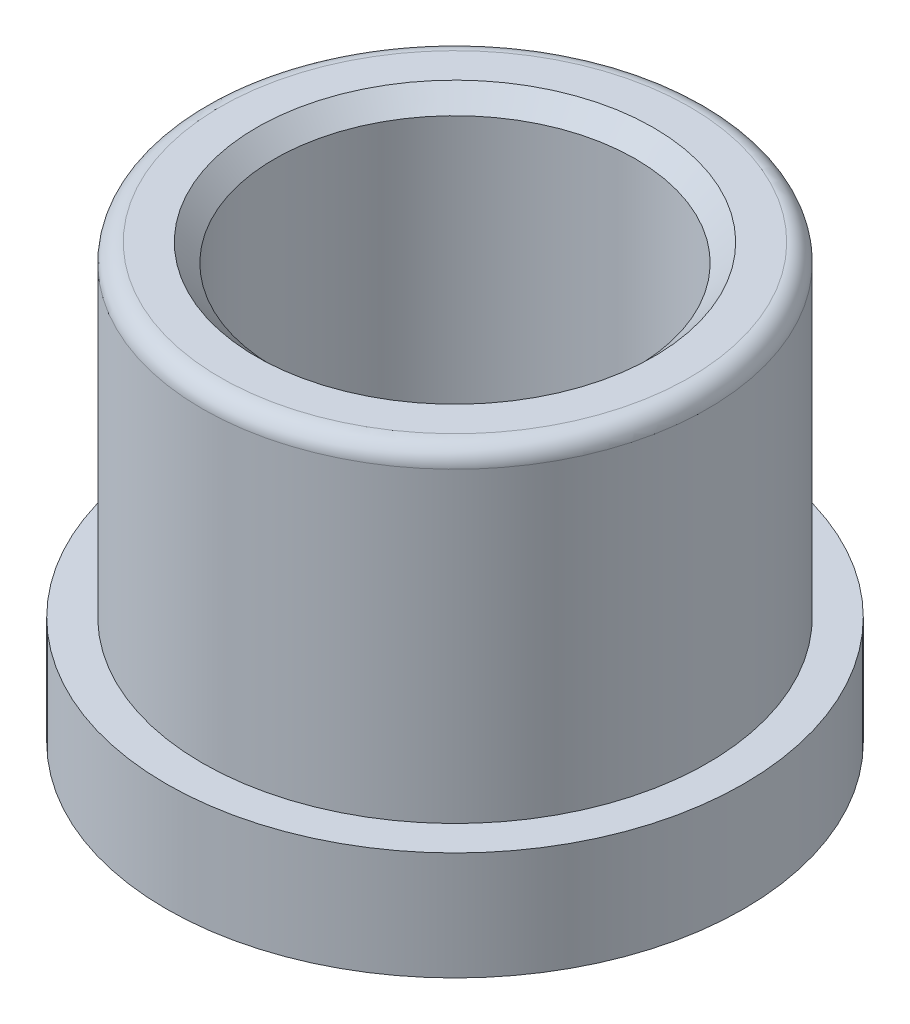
ISO-10303-21;
HEADER;
FILE_DESCRIPTION(('STEP AP214'),'2;1');
FILE_NAME('part.step','',(''),(''),'','','');
FILE_SCHEMA(('AUTOMOTIVE_DESIGN { 1 0 10303 214 1 1 1 1 }'));
ENDSEC;
DATA;
#1=APPLICATION_CONTEXT('core data for automotive mechanical design processes');
#2=APPLICATION_PROTOCOL_DEFINITION('international standard','automotive_design',2000,#1);
#3=PRODUCT_CONTEXT('',#1,'mechanical');
#4=PRODUCT('Part','Part','',(#3));
#5=PRODUCT_RELATED_PRODUCT_CATEGORY('part','',(#4));
#6=PRODUCT_DEFINITION_FORMATION('','',#4);
#7=PRODUCT_DEFINITION_CONTEXT('part definition',#1,'design');
#8=PRODUCT_DEFINITION('design','',#6,#7);
#9=PRODUCT_DEFINITION_SHAPE('','',#8);
#10=(LENGTH_UNIT() NAMED_UNIT(*) SI_UNIT(.MILLI.,.METRE.));
#11=(NAMED_UNIT(*) PLANE_ANGLE_UNIT() SI_UNIT($,.RADIAN.));
#12=(NAMED_UNIT(*) SI_UNIT($,.STERADIAN.) SOLID_ANGLE_UNIT());
#13=UNCERTAINTY_MEASURE_WITH_UNIT(LENGTH_MEASURE(1.E-05),#10,'distance_accuracy_value','');
#14=(GEOMETRIC_REPRESENTATION_CONTEXT(3) GLOBAL_UNCERTAINTY_ASSIGNED_CONTEXT((#13)) GLOBAL_UNIT_ASSIGNED_CONTEXT((#10,
#11,#12)) REPRESENTATION_CONTEXT('',''));
#15=CARTESIAN_POINT('',(0.,0.,0.));
#16=DIRECTION('',(0.,0.,1.));
#17=DIRECTION('',(1.,0.,0.));
#18=AXIS2_PLACEMENT_3D('',#15,#16,#17);
#19=CARTESIAN_POINT('',(0.,0.,0.));
#20=DIRECTION('',(0.,-1.,0.));
#21=DIRECTION('',(0.,0.,-1.));
#22=AXIS2_PLACEMENT_3D('',#19,#20,#21);
#23=CYLINDRICAL_SURFACE('',#22,7.);
#24=CARTESIAN_POINT('',(0.,8.50000000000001,0.));
#25=DIRECTION('',(0.,-1.,0.));
#26=DIRECTION('',(0.,0.,-1.));
#27=AXIS2_PLACEMENT_3D('',#24,#25,#26);
#28=CIRCLE('',#27,7.);
#29=CARTESIAN_POINT('',(0.,8.50000000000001,-7.));
#30=VERTEX_POINT('',#29);
#31=EDGE_CURVE('E38',#30,#30,#28,.T.);
#32=ORIENTED_EDGE('',*,*,#31,.T.);
#33=EDGE_LOOP('',(#32));
#34=FACE_BOUND('',#33,.T.);
#35=CARTESIAN_POINT('',(0.,0.,0.));
#36=DIRECTION('',(0.,-1.,0.));
#37=DIRECTION('',(0.,0.,-1.));
#38=AXIS2_PLACEMENT_3D('',#35,#36,#37);
#39=CIRCLE('',#38,7.);
#40=CARTESIAN_POINT('',(0.,0.,-7.));
#41=VERTEX_POINT('',#40);
#42=EDGE_CURVE('E66',#41,#41,#39,.T.);
#43=ORIENTED_EDGE('',*,*,#42,.F.);
#44=EDGE_LOOP('',(#43));
#45=FACE_BOUND('',#44,.T.);
#46=ADVANCED_FACE('F31',(#34,#45),#23,.T.);
#47=CARTESIAN_POINT('',(-7.,9.00000000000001,0.));
#48=DIRECTION('',(0.,-1.,0.));
#49=DIRECTION('',(0.,0.,-1.));
#50=AXIS2_PLACEMENT_3D('',#47,#48,#49);
#51=PLANE('',#50);
#52=CARTESIAN_POINT('',(0.,9.00000000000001,0.));
#53=DIRECTION('',(0.,-1.,0.));
#54=DIRECTION('',(0.,0.,-1.));
#55=AXIS2_PLACEMENT_3D('',#52,#53,#54);
#56=CIRCLE('',#55,6.5);
#57=CARTESIAN_POINT('',(0.,9.00000000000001,-6.5));
#58=VERTEX_POINT('',#57);
#59=EDGE_CURVE('E10',#58,#58,#56,.F.);
#60=ORIENTED_EDGE('',*,*,#59,.T.);
#61=EDGE_LOOP('',(#60));
#62=FACE_BOUND('',#61,.T.);
#63=CARTESIAN_POINT('',(0.,9.00000000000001,0.));
#64=DIRECTION('',(0.,-1.,0.));
#65=DIRECTION('',(0.,0.,-1.));
#66=AXIS2_PLACEMENT_3D('',#63,#64,#65);
#67=CIRCLE('',#66,5.49999999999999);
#68=CARTESIAN_POINT('',(0.,9.00000000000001,-5.49999999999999));
#69=VERTEX_POINT('',#68);
#70=EDGE_CURVE('E54',#69,#69,#67,.T.);
#71=ORIENTED_EDGE('',*,*,#70,.T.);
#72=EDGE_LOOP('',(#71));
#73=FACE_BOUND('',#72,.T.);
#74=ADVANCED_FACE('F73',(#62,#73),#51,.F.);
#75=CARTESIAN_POINT('',(0.,0.,0.));
#76=DIRECTION('',(0.,-1.,0.));
#77=DIRECTION('',(0.,0.,-1.));
#78=AXIS2_PLACEMENT_3D('',#75,#76,#77);
#79=CYLINDRICAL_SURFACE('',#78,4.99999999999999);
#80=CARTESIAN_POINT('',(0.,8.5,0.));
#81=DIRECTION('',(0.,-1.,0.));
#82=DIRECTION('',(0.,0.,-1.));
#83=AXIS2_PLACEMENT_3D('',#80,#81,#82);
#84=CIRCLE('',#83,4.99999999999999);
#85=CARTESIAN_POINT('',(0.,8.5,-4.99999999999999));
#86=VERTEX_POINT('',#85);
#87=EDGE_CURVE('E51',#86,#86,#84,.F.);
#88=ORIENTED_EDGE('',*,*,#87,.T.);
#89=EDGE_LOOP('',(#88));
#90=FACE_BOUND('',#89,.T.);
#91=CARTESIAN_POINT('',(0.,-2.99999999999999,0.));
#92=DIRECTION('',(0.,-1.,0.));
#93=DIRECTION('',(0.,0.,-1.));
#94=AXIS2_PLACEMENT_3D('',#91,#92,#93);
#95=CIRCLE('',#94,4.99999999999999);
#96=CARTESIAN_POINT('',(0.,-2.99999999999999,-4.99999999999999));
#97=VERTEX_POINT('',#96);
#98=EDGE_CURVE('E57',#97,#97,#95,.T.);
#99=ORIENTED_EDGE('',*,*,#98,.T.);
#100=EDGE_LOOP('',(#99));
#101=FACE_BOUND('',#100,.T.);
#102=ADVANCED_FACE('F78',(#90,#101),#79,.F.);
#103=CARTESIAN_POINT('',(0.,-3.14999999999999,0.));
#104=DIRECTION('',(0.,-1.,0.));
#105=DIRECTION('',(0.,0.,-1.));
#106=AXIS2_PLACEMENT_3D('',#103,#104,#105);
#107=CONICAL_SURFACE('',#106,5.09999999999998,0.588002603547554);
#108=CARTESIAN_POINT('',(0.,-3.36,0.));
#109=DIRECTION('',(0.,1.,0.));
#110=DIRECTION('',(0.,0.,1.));
#111=AXIS2_PLACEMENT_3D('',#108,#109,#110);
#112=CIRCLE('',#111,5.23999999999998);
#113=CARTESIAN_POINT('',(0.,-3.36,5.23999999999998));
#114=VERTEX_POINT('',#113);
#115=EDGE_CURVE('E42',#114,#114,#112,.F.);
#116=ORIENTED_EDGE('',*,*,#115,.T.);
#117=EDGE_LOOP('',(#116));
#118=FACE_BOUND('',#117,.T.);
#119=ORIENTED_EDGE('',*,*,#98,.F.);
#120=EDGE_LOOP('',(#119));
#121=FACE_BOUND('',#120,.T.);
#122=ADVANCED_FACE('F96',(#118,#121),#107,.F.);
#123=CARTESIAN_POINT('',(-5.09999999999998,-3.,0.));
#124=DIRECTION('',(0.,1.,0.));
#125=DIRECTION('',(0.,0.,1.));
#126=AXIS2_PLACEMENT_3D('',#123,#124,#125);
#127=PLANE('',#126);
#128=CARTESIAN_POINT('',(0.,-3.,0.));
#129=DIRECTION('',(0.,1.,0.));
#130=DIRECTION('',(0.,0.,1.));
#131=AXIS2_PLACEMENT_3D('',#128,#129,#130);
#132=CIRCLE('',#131,5.59999999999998);
#133=CARTESIAN_POINT('',(0.,-3.,5.59999999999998));
#134=VERTEX_POINT('',#133);
#135=EDGE_CURVE('E46',#134,#134,#132,.T.);
#136=ORIENTED_EDGE('',*,*,#135,.T.);
#137=EDGE_LOOP('',(#136));
#138=FACE_BOUND('',#137,.T.);
#139=CARTESIAN_POINT('',(0.,-3.,0.));
#140=DIRECTION('',(0.,-1.,0.));
#141=DIRECTION('',(0.,0.,-1.));
#142=AXIS2_PLACEMENT_3D('',#139,#140,#141);
#143=CIRCLE('',#142,8.);
#144=CARTESIAN_POINT('',(0.,-3.,-8.));
#145=VERTEX_POINT('',#144);
#146=EDGE_CURVE('E60',#145,#145,#143,.T.);
#147=ORIENTED_EDGE('',*,*,#146,.T.);
#148=EDGE_LOOP('',(#147));
#149=FACE_BOUND('',#148,.T.);
#150=ADVANCED_FACE('F99',(#138,#149),#127,.F.);
#151=CARTESIAN_POINT('',(0.,0.,0.));
#152=DIRECTION('',(0.,-1.,0.));
#153=DIRECTION('',(0.,0.,-1.));
#154=AXIS2_PLACEMENT_3D('',#151,#152,#153);
#155=CYLINDRICAL_SURFACE('',#154,8.);
#156=ORIENTED_EDGE('',*,*,#146,.F.);
#157=EDGE_LOOP('',(#156));
#158=FACE_BOUND('',#157,.T.);
#159=CARTESIAN_POINT('',(0.,0.,0.));
#160=DIRECTION('',(0.,-1.,0.));
#161=DIRECTION('',(0.,0.,-1.));
#162=AXIS2_PLACEMENT_3D('',#159,#160,#161);
#163=CIRCLE('',#162,8.);
#164=CARTESIAN_POINT('',(0.,0.,-8.));
#165=VERTEX_POINT('',#164);
#166=EDGE_CURVE('E63',#165,#165,#163,.T.);
#167=ORIENTED_EDGE('',*,*,#166,.T.);
#168=EDGE_LOOP('',(#167));
#169=FACE_BOUND('',#168,.T.);
#170=ADVANCED_FACE('F110',(#158,#169),#155,.T.);
#171=CARTESIAN_POINT('',(-8.,0.,0.));
#172=DIRECTION('',(0.,-1.,0.));
#173=DIRECTION('',(0.,0.,-1.));
#174=AXIS2_PLACEMENT_3D('',#171,#172,#173);
#175=PLANE('',#174);
#176=ORIENTED_EDGE('',*,*,#166,.F.);
#177=EDGE_LOOP('',(#176));
#178=FACE_BOUND('',#177,.T.);
#179=ORIENTED_EDGE('',*,*,#42,.T.);
#180=EDGE_LOOP('',(#179));
#181=FACE_BOUND('',#180,.T.);
#182=ADVANCED_FACE('F70',(#178,#181),#175,.F.);
#183=CARTESIAN_POINT('',(0.,9.00000000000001,0.));
#184=DIRECTION('',(0.,1.,0.));
#185=DIRECTION('',(0.,0.,1.));
#186=AXIS2_PLACEMENT_3D('',#183,#184,#185);
#187=CONICAL_SURFACE('',#186,5.49999999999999,0.785398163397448);
#188=ORIENTED_EDGE('',*,*,#87,.F.);
#189=EDGE_LOOP('',(#188));
#190=FACE_BOUND('',#189,.T.);
#191=ORIENTED_EDGE('',*,*,#70,.F.);
#192=EDGE_LOOP('',(#191));
#193=FACE_BOUND('',#192,.T.);
#194=ADVANCED_FACE('F82',(#190,#193),#187,.F.);
#195=CARTESIAN_POINT('',(0.,-3.5,0.));
#196=DIRECTION('',(0.,1.,0.));
#197=DIRECTION('',(0.,0.,1.));
#198=AXIS2_PLACEMENT_3D('',#195,#196,#197);
#199=CONICAL_SURFACE('',#198,5.09999999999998,0.785398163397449);
#200=ORIENTED_EDGE('',*,*,#135,.F.);
#201=EDGE_LOOP('',(#200));
#202=FACE_BOUND('',#201,.T.);
#203=ORIENTED_EDGE('',*,*,#115,.F.);
#204=EDGE_LOOP('',(#203));
#205=FACE_BOUND('',#204,.T.);
#206=ADVANCED_FACE('F84',(#202,#205),#199,.T.);
#207=CARTESIAN_POINT('',(0.,8.50000000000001,0.));
#208=DIRECTION('',(0.,-1.,0.));
#209=DIRECTION('',(0.,0.,-1.));
#210=AXIS2_PLACEMENT_3D('',#207,#208,#209);
#211=TOROIDAL_SURFACE('',#210,6.5,0.5);
#212=ORIENTED_EDGE('',*,*,#59,.F.);
#213=EDGE_LOOP('',(#212));
#214=FACE_BOUND('',#213,.T.);
#215=ORIENTED_EDGE('',*,*,#31,.F.);
#216=EDGE_LOOP('',(#215));
#217=FACE_BOUND('',#216,.T.);
#218=ADVANCED_FACE('F33',(#214,#217),#211,.T.);
#219=CLOSED_SHELL('',(#46,#74,#102,#122,#150,#170,#182,#194,#206,#218));
#220=MANIFOLD_SOLID_BREP('B2',#219);
#221=ADVANCED_BREP_SHAPE_REPRESENTATION('',(#18,#220),#14);
#222=SHAPE_DEFINITION_REPRESENTATION(#9,#221);
ENDSEC;
END-ISO-10303-21;
